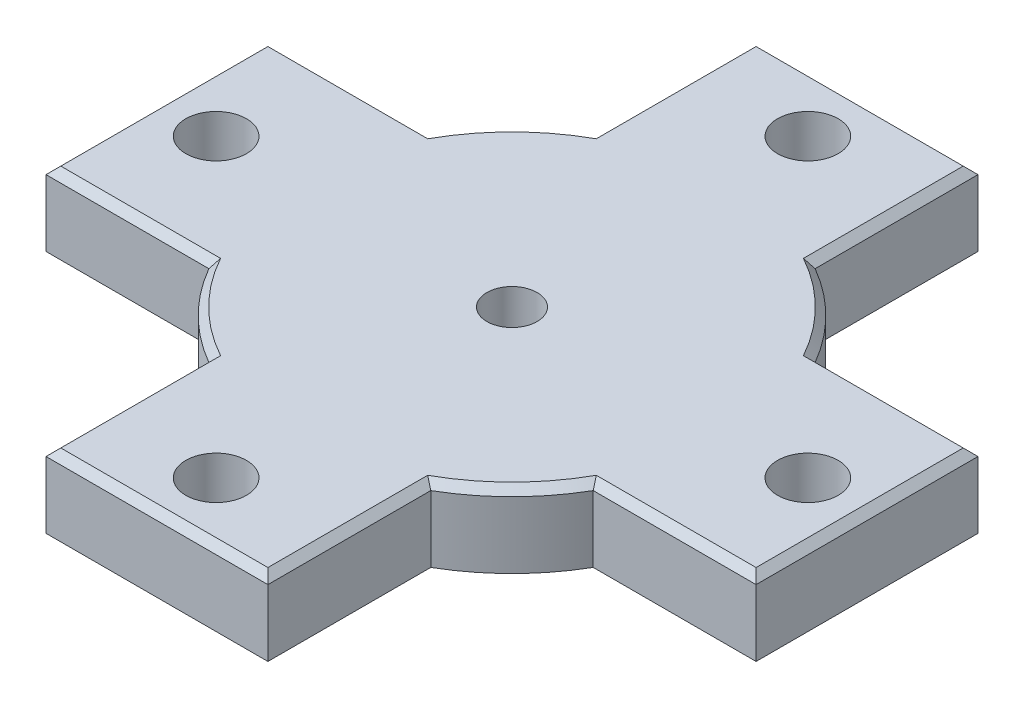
from build123d import *

# Parameters (mm, degrees)
EXTRUDE_1_DEPTH          = 10
CHAMFER_1_SIZE           = 1
HOLE_WIZARD_M8_1_D       = 6.8
HOLE_WIZARD_M8_1_DEPTH   = 19.75
HOLE_WIZARD_M8_1_TIP     = 2.042926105
HOLE_WIZARD_8_2_8_2_1_D  = 8.2
PATTERN_CIRCULAR_1_COUNT = 4


with BuildPart() as part:
    # Sketch 1 → Extrude 1 (new body)
    with BuildSketch(Plane(origin=(0, 0, 0), x_dir=(1, 0, 0), z_dir=(0, 1, 0))):
        with BuildLine():
            Line((-15, 25.980762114), (-15, 48))
            Line((-15, 48), (15, 48))
            Line((15, 48), (15, 25.980762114))
            ThreePointArc((15, 25.980762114), (21.213203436, 21.213203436), (25.980762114, 15))
            Line((25.980762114, 15), (48, 15))
            Line((48, 15), (48, -15))
            Line((48, -15), (25.980762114, -15))
            ThreePointArc((25.980762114, -15), (21.213203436, -21.213203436), (15, -25.980762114))
            Line((15, -25.980762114), (15, -48))
            Line((15, -48), (-15, -48))
            Line((-15, -48), (-15, -25.980762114))
            ThreePointArc((-15, -25.980762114), (-21.213203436, -21.213203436), (-25.980762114, -15))
            Line((-25.980762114, -15), (-48, -15))
            Line((-48, -15), (-48, 15))
            Line((-48, 15), (-25.980762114, 15))
            ThreePointArc((-25.980762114, 15), (-21.213203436, 21.213203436), (-15, 25.980762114))
        make_face()
    extrude(amount=EXTRUDE_1_DEPTH)

    # Chamfer 1
    chamfer_1_edges = [part.edges().sort_by_distance(p)[0] for p in [
        (-48, 10, 0),
        (-36.990381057, 10, 15),
        (-21.213203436, 10, 21.213203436),
        (-15, 10, 36.990381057),
        (0, 10, 48),
        (15, 10, 36.990381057),
        (21.213203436, 10, 21.213203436),
        (36.990381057, 10, 15),
        (48, 10, 0),
        (36.990381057, 10, -15),
        (-21.213203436, 10, -21.213203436),
        (21.213203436, 10, -21.213203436),
        (15, 10, -36.990381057),
        (0, 10, -48),
        (-15, 10, -36.990381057),
        (-36.990381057, 10, -15),
    ]]
    chamfer(chamfer_1_edges, length=CHAMFER_1_SIZE)

    # Hole Wizard M8 _1
    with Locations(Plane(origin=(0, 10, 0), x_dir=(1, 0, 0), z_dir=(0, 1, 0))):
        with Locations((0, 0)):
            Hole(HOLE_WIZARD_M8_1_D / 2, depth=HOLE_WIZARD_M8_1_DEPTH)
            with Locations((0, 0, -(HOLE_WIZARD_M8_1_DEPTH + HOLE_WIZARD_M8_1_TIP / 2))):  # 118° drill point
                Cone(0, HOLE_WIZARD_M8_1_D / 2, HOLE_WIZARD_M8_1_TIP, mode=Mode.SUBTRACT)

    # Hole Wizard 8.2 _8.2_ _1 (through all)
    with Locations(Plane(origin=(0, 10, 0), x_dir=(1, 0, 0), z_dir=(0, 1, 0))):
        with Locations((0, -40)):
            hole_wizard_8_2_8_2_1 = Hole(HOLE_WIZARD_8_2_8_2_1_D / 2)

    # Pattern Circular 1: Hole Wizard 8.2 _8.2_ _1 ×4 about axis
    pattern_circular_1_axis = Axis((0, 0, 0), (0, 1, 0))
    for i in range(1, PATTERN_CIRCULAR_1_COUNT):
        add(hole_wizard_8_2_8_2_1.rotate(pattern_circular_1_axis, i * 360 / PATTERN_CIRCULAR_1_COUNT), mode=Mode.SUBTRACT)


solid = part.part
